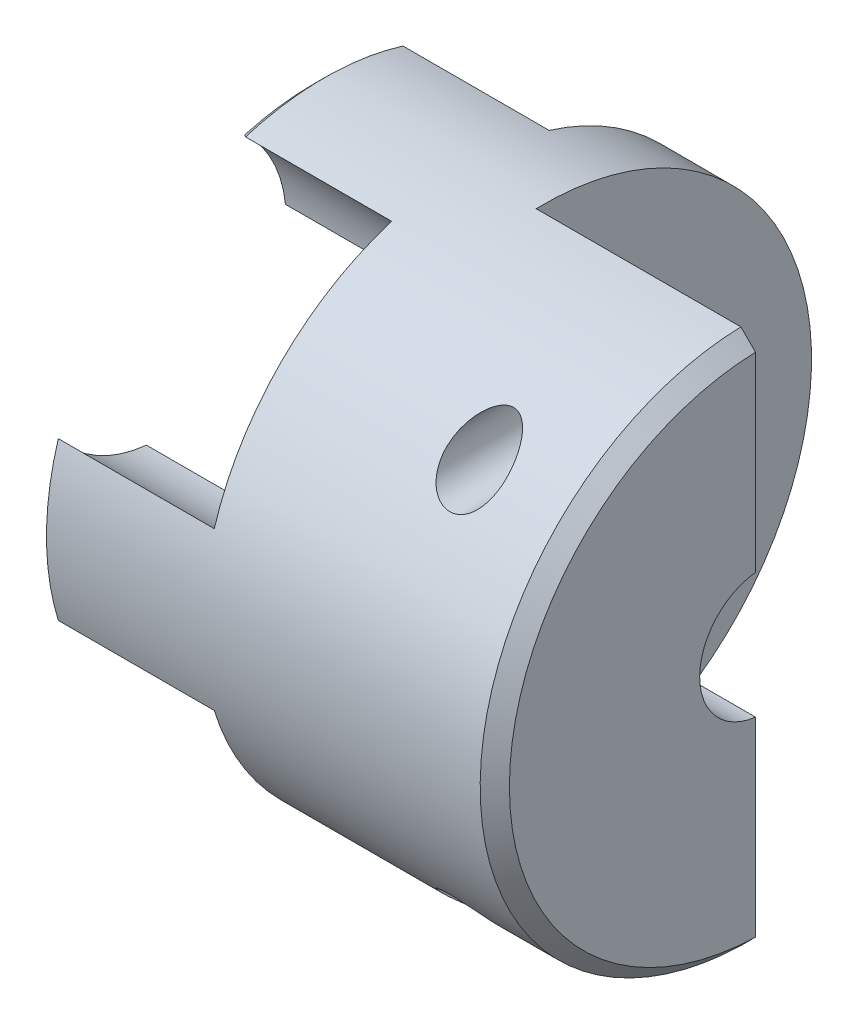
ISO-10303-21;
HEADER;
FILE_DESCRIPTION(('STEP AP214'),'2;1');
FILE_NAME('part.step','',(''),(''),'','','');
FILE_SCHEMA(('AUTOMOTIVE_DESIGN { 1 0 10303 214 1 1 1 1 }'));
ENDSEC;
DATA;
#1=APPLICATION_CONTEXT('core data for automotive mechanical design processes');
#2=APPLICATION_PROTOCOL_DEFINITION('international standard','automotive_design',2000,#1);
#3=PRODUCT_CONTEXT('',#1,'mechanical');
#4=PRODUCT('Part','Part','',(#3));
#5=PRODUCT_RELATED_PRODUCT_CATEGORY('part','',(#4));
#6=PRODUCT_DEFINITION_FORMATION('','',#4);
#7=PRODUCT_DEFINITION_CONTEXT('part definition',#1,'design');
#8=PRODUCT_DEFINITION('design','',#6,#7);
#9=PRODUCT_DEFINITION_SHAPE('','',#8);
#10=(LENGTH_UNIT() NAMED_UNIT(*) SI_UNIT(.MILLI.,.METRE.));
#11=(NAMED_UNIT(*) PLANE_ANGLE_UNIT() SI_UNIT($,.RADIAN.));
#12=(NAMED_UNIT(*) SI_UNIT($,.STERADIAN.) SOLID_ANGLE_UNIT());
#13=UNCERTAINTY_MEASURE_WITH_UNIT(LENGTH_MEASURE(1.E-05),#10,'distance_accuracy_value','');
#14=(GEOMETRIC_REPRESENTATION_CONTEXT(3) GLOBAL_UNCERTAINTY_ASSIGNED_CONTEXT((#13)) GLOBAL_UNIT_ASSIGNED_CONTEXT((#10,
#11,#12)) REPRESENTATION_CONTEXT('',''));
#15=CARTESIAN_POINT('',(0.,0.,0.));
#16=DIRECTION('',(0.,0.,1.));
#17=DIRECTION('',(1.,0.,0.));
#18=AXIS2_PLACEMENT_3D('',#15,#16,#17);
#19=CARTESIAN_POINT('',(0.,0.,0.));
#20=DIRECTION('',(1.,0.,0.));
#21=DIRECTION('',(0.,0.,-1.));
#22=AXIS2_PLACEMENT_3D('',#19,#20,#21);
#23=PLANE('',#22);
#24=CARTESIAN_POINT('',(0.,-15.9099025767,15.9099025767));
#25=DIRECTION('',(-1.,0.,0.));
#26=DIRECTION('',(0.,0.,1.));
#27=AXIS2_PLACEMENT_3D('',#24,#25,#26);
#28=CIRCLE('',#27,13.);
#29=CARTESIAN_POINT('',(3.34801630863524E-13,-25.5167588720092,7.15157441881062));
#30=VERTEX_POINT('',#29);
#31=CARTESIAN_POINT('',(0.,-17.2446487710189,2.97860517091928));
#32=VERTEX_POINT('',#31);
#33=EDGE_CURVE('E402',#30,#32,#28,.F.);
#34=ORIENTED_EDGE('',*,*,#33,.T.);
#35=CARTESIAN_POINT('',(0.,0.,0.));
#36=DIRECTION('',(-1.,0.,0.));
#37=DIRECTION('',(0.,0.,1.));
#38=AXIS2_PLACEMENT_3D('',#35,#36,#37);
#39=CIRCLE('',#38,17.5);
#40=CARTESIAN_POINT('',(0.,-17.2446487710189,-2.97860517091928));
#41=VERTEX_POINT('',#40);
#42=EDGE_CURVE('E403',#32,#41,#39,.F.);
#43=ORIENTED_EDGE('',*,*,#42,.T.);
#44=CARTESIAN_POINT('',(0.,-15.9099025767,-15.9099025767));
#45=DIRECTION('',(-1.,0.,0.));
#46=DIRECTION('',(0.,0.,1.));
#47=AXIS2_PLACEMENT_3D('',#44,#45,#46);
#48=CIRCLE('',#47,13.);
#49=CARTESIAN_POINT('',(3.34801630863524E-13,-25.5167588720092,-7.15157441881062));
#50=VERTEX_POINT('',#49);
#51=EDGE_CURVE('E409',#41,#50,#48,.F.);
#52=ORIENTED_EDGE('',*,*,#51,.T.);
#53=CARTESIAN_POINT('',(6.69603261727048E-13,0.,0.));
#54=DIRECTION('',(1.,0.,0.));
#55=DIRECTION('',(0.,0.,-1.));
#56=AXIS2_PLACEMENT_3D('',#53,#54,#55);
#57=CIRCLE('',#56,26.5000000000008);
#58=EDGE_CURVE('E406',#30,#50,#57,.T.);
#59=ORIENTED_EDGE('',*,*,#58,.F.);
#60=EDGE_LOOP('',(#34,#43,#52,#59));
#61=FACE_BOUND('',#60,.T.);
#62=ADVANCED_FACE('F16',(#61),#23,.F.);
#63=CARTESIAN_POINT('',(35.5,-20.,0.750000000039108));
#64=DIRECTION('',(0.,0.,-1.));
#65=DIRECTION('',(-1.,0.,0.));
#66=AXIS2_PLACEMENT_3D('',#63,#64,#65);
#67=CONICAL_SURFACE('',#66,3.02499999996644,0.39269908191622);
#68=CARTESIAN_POINT('',(35.5,-20.,0.750000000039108));
#69=DIRECTION('',(0.,0.,-1.));
#70=DIRECTION('',(-1.,0.,0.));
#71=AXIS2_PLACEMENT_3D('',#68,#69,#70);
#72=CIRCLE('',#71,3.02499999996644);
#73=CARTESIAN_POINT('',(32.4750000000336,-20.,0.750000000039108));
#74=VERTEX_POINT('',#73);
#75=EDGE_CURVE('E210',#74,#74,#72,.T.);
#76=ORIENTED_EDGE('',*,*,#75,.T.);
#77=EDGE_LOOP('',(#76));
#78=FACE_BOUND('',#77,.T.);
#79=CARTESIAN_POINT('',(35.5,-20.,0.8103553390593));
#80=DIRECTION('',(0.,0.,-1.));
#81=DIRECTION('',(-1.,0.,0.));
#82=AXIS2_PLACEMENT_3D('',#79,#80,#81);
#83=CIRCLE('',#82,3.);
#84=CARTESIAN_POINT('',(32.5,-20.,0.8103553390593));
#85=VERTEX_POINT('',#84);
#86=EDGE_CURVE('E212',#85,#85,#83,.F.);
#87=ORIENTED_EDGE('',*,*,#86,.T.);
#88=EDGE_LOOP('',(#87));
#89=FACE_BOUND('',#88,.T.);
#90=ADVANCED_FACE('F751',(#78,#89),#67,.F.);
#91=CARTESIAN_POINT('',(0.,0.,0.));
#92=DIRECTION('',(1.,0.,0.));
#93=DIRECTION('',(0.,0.,-1.));
#94=AXIS2_PLACEMENT_3D('',#91,#92,#93);
#95=PLANE('',#94);
#96=CARTESIAN_POINT('',(0.,0.,0.));
#97=DIRECTION('',(1.,0.,0.));
#98=DIRECTION('',(0.,0.,-1.));
#99=AXIS2_PLACEMENT_3D('',#96,#97,#98);
#100=CIRCLE('',#99,26.5000000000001);
#101=CARTESIAN_POINT('',(3.34801630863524E-13,-7.15157441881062,-25.5167588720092));
#102=VERTEX_POINT('',#101);
#103=CARTESIAN_POINT('',(0.,7.1515744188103,-25.5167588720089));
#104=VERTEX_POINT('',#103);
#105=EDGE_CURVE('E294',#102,#104,#100,.T.);
#106=ORIENTED_EDGE('',*,*,#105,.F.);
#107=CARTESIAN_POINT('',(0.,-15.9099025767,-15.9099025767));
#108=DIRECTION('',(-1.,0.,0.));
#109=DIRECTION('',(0.,0.,1.));
#110=AXIS2_PLACEMENT_3D('',#107,#108,#109);
#111=CIRCLE('',#110,13.);
#112=CARTESIAN_POINT('',(0.,-2.97860517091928,-17.2446487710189));
#113=VERTEX_POINT('',#112);
#114=EDGE_CURVE('E272',#102,#113,#111,.F.);
#115=ORIENTED_EDGE('',*,*,#114,.T.);
#116=CARTESIAN_POINT('',(0.,0.,0.));
#117=DIRECTION('',(-1.,0.,0.));
#118=DIRECTION('',(0.,0.,1.));
#119=AXIS2_PLACEMENT_3D('',#116,#117,#118);
#120=CIRCLE('',#119,17.5);
#121=CARTESIAN_POINT('',(0.,2.97860517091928,-17.2446487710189));
#122=VERTEX_POINT('',#121);
#123=EDGE_CURVE('E193',#113,#122,#120,.F.);
#124=ORIENTED_EDGE('',*,*,#123,.T.);
#125=CARTESIAN_POINT('',(0.,15.9099025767,-15.9099025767));
#126=DIRECTION('',(-1.,0.,0.));
#127=DIRECTION('',(0.,0.,1.));
#128=AXIS2_PLACEMENT_3D('',#125,#126,#127);
#129=CIRCLE('',#128,13.);
#130=EDGE_CURVE('E292',#122,#104,#129,.F.);
#131=ORIENTED_EDGE('',*,*,#130,.T.);
#132=EDGE_LOOP('',(#106,#115,#124,#131));
#133=FACE_BOUND('',#132,.T.);
#134=ADVANCED_FACE('F446',(#133),#95,.F.);
#135=CARTESIAN_POINT('',(0.,0.,0.));
#136=DIRECTION('',(1.,0.,0.));
#137=DIRECTION('',(0.,0.,-1.));
#138=AXIS2_PLACEMENT_3D('',#135,#136,#137);
#139=PLANE('',#138);
#140=CARTESIAN_POINT('',(0.,15.9099025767,-15.9099025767));
#141=DIRECTION('',(-1.,0.,0.));
#142=DIRECTION('',(0.,0.,1.));
#143=AXIS2_PLACEMENT_3D('',#140,#141,#142);
#144=CIRCLE('',#143,13.);
#145=CARTESIAN_POINT('',(3.34801630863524E-13,25.5167588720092,-7.15157441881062));
#146=VERTEX_POINT('',#145);
#147=CARTESIAN_POINT('',(0.,17.2446487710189,-2.97860517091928));
#148=VERTEX_POINT('',#147);
#149=EDGE_CURVE('E175',#146,#148,#144,.F.);
#150=ORIENTED_EDGE('',*,*,#149,.T.);
#151=CARTESIAN_POINT('',(0.,0.,0.));
#152=DIRECTION('',(-1.,0.,0.));
#153=DIRECTION('',(0.,0.,1.));
#154=AXIS2_PLACEMENT_3D('',#151,#152,#153);
#155=CIRCLE('',#154,17.5);
#156=CARTESIAN_POINT('',(0.,17.2446487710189,2.97860517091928));
#157=VERTEX_POINT('',#156);
#158=EDGE_CURVE('E19',#148,#157,#155,.F.);
#159=ORIENTED_EDGE('',*,*,#158,.T.);
#160=CARTESIAN_POINT('',(0.,15.9099025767,15.9099025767));
#161=DIRECTION('',(-1.,0.,0.));
#162=DIRECTION('',(0.,0.,1.));
#163=AXIS2_PLACEMENT_3D('',#160,#161,#162);
#164=CIRCLE('',#163,13.);
#165=CARTESIAN_POINT('',(3.34801630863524E-13,25.5167588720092,7.15157441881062));
#166=VERTEX_POINT('',#165);
#167=EDGE_CURVE('E206',#157,#166,#164,.F.);
#168=ORIENTED_EDGE('',*,*,#167,.T.);
#169=CARTESIAN_POINT('',(6.69603261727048E-13,0.,0.));
#170=DIRECTION('',(1.,0.,0.));
#171=DIRECTION('',(0.,0.,-1.));
#172=AXIS2_PLACEMENT_3D('',#169,#170,#171);
#173=CIRCLE('',#172,26.5000000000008);
#174=EDGE_CURVE('E180',#146,#166,#173,.T.);
#175=ORIENTED_EDGE('',*,*,#174,.F.);
#176=EDGE_LOOP('',(#150,#159,#168,#175));
#177=FACE_BOUND('',#176,.T.);
#178=ADVANCED_FACE('F177',(#177),#139,.F.);
#179=CARTESIAN_POINT('',(16.,0.,0.));
#180=DIRECTION('',(-1.,0.,0.));
#181=DIRECTION('',(0.,0.,1.));
#182=AXIS2_PLACEMENT_3D('',#179,#180,#181);
#183=CYLINDRICAL_SURFACE('',#182,17.5);
#184=ORIENTED_EDGE('',*,*,#158,.F.);
#185=DIRECTION('',(-1.,0.,0.));
#186=VECTOR('',#185,1.);
#187=CARTESIAN_POINT('',(16.,17.2446487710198,-2.97860517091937));
#188=LINE('',#187,#186);
#189=CARTESIAN_POINT('',(16.,17.2446487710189,-2.97860517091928));
#190=VERTEX_POINT('',#189);
#191=EDGE_CURVE('E184',#148,#190,#188,.F.);
#192=ORIENTED_EDGE('',*,*,#191,.T.);
#193=CARTESIAN_POINT('',(16.,0.,0.));
#194=DIRECTION('',(-1.,0.,0.));
#195=DIRECTION('',(0.,0.,1.));
#196=AXIS2_PLACEMENT_3D('',#193,#194,#195);
#197=CIRCLE('',#196,17.5);
#198=CARTESIAN_POINT('',(16.,17.2446487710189,2.97860517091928));
#199=VERTEX_POINT('',#198);
#200=EDGE_CURVE('E473',#199,#190,#197,.T.);
#201=ORIENTED_EDGE('',*,*,#200,.F.);
#202=DIRECTION('',(-1.,0.,0.));
#203=VECTOR('',#202,1.);
#204=CARTESIAN_POINT('',(16.,17.2446487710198,2.97860517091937));
#205=LINE('',#204,#203);
#206=EDGE_CURVE('E191',#199,#157,#205,.T.);
#207=ORIENTED_EDGE('',*,*,#206,.T.);
#208=EDGE_LOOP('',(#184,#192,#201,#207));
#209=FACE_BOUND('',#208,.T.);
#210=ADVANCED_FACE('F188',(#209),#183,.F.);
#211=CARTESIAN_POINT('',(16.,0.,0.));
#212=DIRECTION('',(-1.,0.,0.));
#213=DIRECTION('',(0.,0.,1.));
#214=AXIS2_PLACEMENT_3D('',#211,#212,#213);
#215=CYLINDRICAL_SURFACE('',#214,17.5);
#216=DIRECTION('',(-1.,0.,0.));
#217=VECTOR('',#216,1.);
#218=CARTESIAN_POINT('',(16.,-2.97860517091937,-17.2446487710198));
#219=LINE('',#218,#217);
#220=CARTESIAN_POINT('',(16.,-2.97860517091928,-17.2446487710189));
#221=VERTEX_POINT('',#220);
#222=EDGE_CURVE('E270',#113,#221,#219,.F.);
#223=ORIENTED_EDGE('',*,*,#222,.T.);
#224=CARTESIAN_POINT('',(16.,0.,0.));
#225=DIRECTION('',(-1.,0.,0.));
#226=DIRECTION('',(0.,0.,1.));
#227=AXIS2_PLACEMENT_3D('',#224,#225,#226);
#228=CIRCLE('',#227,17.5);
#229=CARTESIAN_POINT('',(16.,2.97860517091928,-17.2446487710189));
#230=VERTEX_POINT('',#229);
#231=EDGE_CURVE('E451',#230,#221,#228,.T.);
#232=ORIENTED_EDGE('',*,*,#231,.F.);
#233=DIRECTION('',(-1.,0.,0.));
#234=VECTOR('',#233,1.);
#235=CARTESIAN_POINT('',(16.,2.97860517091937,-17.2446487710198));
#236=LINE('',#235,#234);
#237=EDGE_CURVE('E203',#230,#122,#236,.T.);
#238=ORIENTED_EDGE('',*,*,#237,.T.);
#239=ORIENTED_EDGE('',*,*,#123,.F.);
#240=EDGE_LOOP('',(#223,#232,#238,#239));
#241=FACE_BOUND('',#240,.T.);
#242=ADVANCED_FACE('F449',(#241),#215,.F.);
#243=CARTESIAN_POINT('',(16.,0.,0.));
#244=DIRECTION('',(-1.,0.,0.));
#245=DIRECTION('',(0.,0.,1.));
#246=AXIS2_PLACEMENT_3D('',#243,#244,#245);
#247=CYLINDRICAL_SURFACE('',#246,17.5);
#248=CARTESIAN_POINT('',(16.,0.,0.));
#249=DIRECTION('',(-1.,0.,0.));
#250=DIRECTION('',(0.,0.,1.));
#251=AXIS2_PLACEMENT_3D('',#248,#249,#250);
#252=CIRCLE('',#251,17.5);
#253=CARTESIAN_POINT('',(16.,-17.2446487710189,-2.97860517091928));
#254=VERTEX_POINT('',#253);
#255=CARTESIAN_POINT('',(16.,-17.2446487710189,2.97860517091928));
#256=VERTEX_POINT('',#255);
#257=EDGE_CURVE('E530',#254,#256,#252,.T.);
#258=ORIENTED_EDGE('',*,*,#257,.F.);
#259=DIRECTION('',(-1.,0.,0.));
#260=VECTOR('',#259,1.);
#261=CARTESIAN_POINT('',(16.,-17.2446487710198,-2.97860517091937));
#262=LINE('',#261,#260);
#263=EDGE_CURVE('E407',#254,#41,#262,.T.);
#264=ORIENTED_EDGE('',*,*,#263,.T.);
#265=ORIENTED_EDGE('',*,*,#42,.F.);
#266=DIRECTION('',(-1.,0.,0.));
#267=VECTOR('',#266,1.);
#268=CARTESIAN_POINT('',(16.,-17.2446487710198,2.97860517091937));
#269=LINE('',#268,#267);
#270=EDGE_CURVE('E404',#32,#256,#269,.F.);
#271=ORIENTED_EDGE('',*,*,#270,.T.);
#272=EDGE_LOOP('',(#258,#264,#265,#271));
#273=FACE_BOUND('',#272,.T.);
#274=ADVANCED_FACE('F538',(#273),#247,.F.);
#275=CARTESIAN_POINT('',(16.,0.,0.));
#276=DIRECTION('',(-1.,0.,0.));
#277=DIRECTION('',(0.,0.,1.));
#278=AXIS2_PLACEMENT_3D('',#275,#276,#277);
#279=CYLINDRICAL_SURFACE('',#278,17.5);
#280=CARTESIAN_POINT('',(0.,0.,0.));
#281=DIRECTION('',(-1.,0.,0.));
#282=DIRECTION('',(0.,0.,1.));
#283=AXIS2_PLACEMENT_3D('',#280,#281,#282);
#284=CIRCLE('',#283,17.5);
#285=CARTESIAN_POINT('',(0.,-2.97860517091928,17.2446487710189));
#286=VERTEX_POINT('',#285);
#287=CARTESIAN_POINT('',(0.,2.97860517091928,17.2446487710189));
#288=VERTEX_POINT('',#287);
#289=EDGE_CURVE('E559',#286,#288,#284,.T.);
#290=ORIENTED_EDGE('',*,*,#289,.T.);
#291=DIRECTION('',(-1.,0.,0.));
#292=VECTOR('',#291,1.);
#293=CARTESIAN_POINT('',(16.,2.97860517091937,17.2446487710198));
#294=LINE('',#293,#292);
#295=CARTESIAN_POINT('',(16.,2.97860517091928,17.2446487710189));
#296=VERTEX_POINT('',#295);
#297=EDGE_CURVE('E394',#288,#296,#294,.F.);
#298=ORIENTED_EDGE('',*,*,#297,.T.);
#299=CARTESIAN_POINT('',(16.,0.,0.));
#300=DIRECTION('',(-1.,0.,0.));
#301=DIRECTION('',(0.,0.,1.));
#302=AXIS2_PLACEMENT_3D('',#299,#300,#301);
#303=CIRCLE('',#302,17.5);
#304=CARTESIAN_POINT('',(16.,-2.97860517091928,17.2446487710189));
#305=VERTEX_POINT('',#304);
#306=EDGE_CURVE('E520',#305,#296,#303,.T.);
#307=ORIENTED_EDGE('',*,*,#306,.F.);
#308=DIRECTION('',(-1.,0.,0.));
#309=VECTOR('',#308,1.);
#310=CARTESIAN_POINT('',(16.,-2.97860517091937,17.2446487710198));
#311=LINE('',#310,#309);
#312=EDGE_CURVE('E399',#305,#286,#311,.T.);
#313=ORIENTED_EDGE('',*,*,#312,.T.);
#314=EDGE_LOOP('',(#290,#298,#307,#313));
#315=FACE_BOUND('',#314,.T.);
#316=ADVANCED_FACE('F553',(#315),#279,.F.);
#317=CARTESIAN_POINT('',(16.,-15.9099025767,15.9099025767));
#318=DIRECTION('',(-1.,0.,0.));
#319=DIRECTION('',(0.,0.,1.));
#320=AXIS2_PLACEMENT_3D('',#317,#318,#319);
#321=CYLINDRICAL_SURFACE('',#320,13.);
#322=CARTESIAN_POINT('',(0.,-15.9099025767,15.9099025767));
#323=DIRECTION('',(-1.,0.,0.));
#324=DIRECTION('',(0.,0.,1.));
#325=AXIS2_PLACEMENT_3D('',#322,#323,#324);
#326=CIRCLE('',#325,13.);
#327=CARTESIAN_POINT('',(0.,-8.07884944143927,26.2865401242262));
#328=VERTEX_POINT('',#327);
#329=EDGE_CURVE('E550',#328,#286,#326,.T.);
#330=ORIENTED_EDGE('',*,*,#329,.T.);
#331=ORIENTED_EDGE('',*,*,#312,.F.);
#332=CARTESIAN_POINT('',(16.,-15.9099025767,15.9099025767));
#333=DIRECTION('',(-1.,0.,0.));
#334=DIRECTION('',(0.,0.,1.));
#335=AXIS2_PLACEMENT_3D('',#332,#333,#334);
#336=CIRCLE('',#335,13.);
#337=CARTESIAN_POINT('',(16.,-8.07884944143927,26.2865401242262));
#338=VERTEX_POINT('',#337);
#339=EDGE_CURVE('E522',#338,#305,#336,.T.);
#340=ORIENTED_EDGE('',*,*,#339,.F.);
#341=DIRECTION('',(-1.,0.,0.));
#342=VECTOR('',#341,1.);
#343=CARTESIAN_POINT('',(46.,-8.07884944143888,26.2865401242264));
#344=LINE('',#343,#342);
#345=EDGE_CURVE('E392',#328,#338,#344,.F.);
#346=ORIENTED_EDGE('',*,*,#345,.F.);
#347=EDGE_LOOP('',(#330,#331,#340,#346));
#348=FACE_BOUND('',#347,.T.);
#349=ADVANCED_FACE('F549',(#348),#321,.F.);
#350=CARTESIAN_POINT('',(16.,-15.9099025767,15.9099025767));
#351=DIRECTION('',(-1.,0.,0.));
#352=DIRECTION('',(0.,0.,1.));
#353=AXIS2_PLACEMENT_3D('',#350,#351,#352);
#354=CYLINDRICAL_SURFACE('',#353,13.);
#355=DIRECTION('',(-1.,0.,0.));
#356=VECTOR('',#355,1.);
#357=CARTESIAN_POINT('',(46.,-26.2865401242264,8.07884944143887));
#358=LINE('',#357,#356);
#359=CARTESIAN_POINT('',(16.,-26.2865401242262,8.07884944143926));
#360=VERTEX_POINT('',#359);
#361=CARTESIAN_POINT('',(1.00000000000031,-26.2865401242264,8.07884944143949));
#362=VERTEX_POINT('',#361);
#363=EDGE_CURVE('E388',#360,#362,#358,.T.);
#364=ORIENTED_EDGE('',*,*,#363,.F.);
#365=CARTESIAN_POINT('',(16.,-15.9099025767,15.9099025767));
#366=DIRECTION('',(-1.,0.,0.));
#367=DIRECTION('',(0.,0.,1.));
#368=AXIS2_PLACEMENT_3D('',#365,#366,#367);
#369=CIRCLE('',#368,13.);
#370=EDGE_CURVE('E528',#256,#360,#369,.T.);
#371=ORIENTED_EDGE('',*,*,#370,.F.);
#372=ORIENTED_EDGE('',*,*,#270,.F.);
#373=ORIENTED_EDGE('',*,*,#33,.F.);
#374=CARTESIAN_POINT('',(1.00000000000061,-26.2865401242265,8.07884944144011));
#375=CARTESIAN_POINT('',(0.917807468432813,-26.2254369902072,7.99788396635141));
#376=CARTESIAN_POINT('',(0.835311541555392,-26.16353479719,7.91783045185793));
#377=CARTESIAN_POINT('',(0.669763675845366,-26.0382065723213,7.75958714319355));
#378=CARTESIAN_POINT('',(0.58671194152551,-25.974781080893,7.68139670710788));
#379=CARTESIAN_POINT('',(0.420045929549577,-25.8464378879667,7.526862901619));
#380=CARTESIAN_POINT('',(0.336431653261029,-25.7815201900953,7.45051952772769));
#381=CARTESIAN_POINT('',(0.168631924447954,-25.650220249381,7.2996636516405));
#382=CARTESIAN_POINT('',(0.0844462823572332,-25.583837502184,7.22515179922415));
#383=CARTESIAN_POINT('',(4.70862496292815E-13,-25.516758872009,7.15157441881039));
#384=B_SPLINE_CURVE_WITH_KNOTS('',3,(#374,#375,#376,#377,#378,#379,#380,#381,#382,#383),
.UNSPECIFIED.,.F.,.F.,(4,2,2,2,4),(0.,0.391658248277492,0.783179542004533,1.17469988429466,
1.56635718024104),.UNSPECIFIED.);
#385=EDGE_CURVE('E410',#362,#30,#384,.T.);
#386=ORIENTED_EDGE('',*,*,#385,.F.);
#387=EDGE_LOOP('',(#364,#371,#372,#373,#386));
#388=FACE_BOUND('',#387,.T.);
#389=ADVANCED_FACE('F433',(#388),#354,.F.);
#390=CARTESIAN_POINT('',(1.00000000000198,0.,0.));
#391=DIRECTION('',(1.,0.,0.));
#392=DIRECTION('',(0.,0.,-1.));
#393=AXIS2_PLACEMENT_3D('',#390,#391,#392);
#394=CONICAL_SURFACE('',#393,27.5000000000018,0.785398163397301);
#395=CARTESIAN_POINT('',(1.,0.,0.));
#396=DIRECTION('',(-1.,0.,0.));
#397=DIRECTION('',(0.,0.,1.));
#398=AXIS2_PLACEMENT_3D('',#395,#396,#397);
#399=CIRCLE('',#398,27.5);
#400=CARTESIAN_POINT('',(1.00000000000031,-26.2865401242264,-8.07884944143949));
#401=VERTEX_POINT('',#400);
#402=EDGE_CURVE('E385',#362,#401,#399,.F.);
#403=ORIENTED_EDGE('',*,*,#402,.F.);
#404=ORIENTED_EDGE('',*,*,#385,.T.);
#405=ORIENTED_EDGE('',*,*,#58,.T.);
#406=CARTESIAN_POINT('',(4.65861179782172E-13,-25.516758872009,-7.15157441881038));
#407=CARTESIAN_POINT('',(0.0844462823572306,-25.583837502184,-7.22515179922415));
#408=CARTESIAN_POINT('',(0.168631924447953,-25.650220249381,-7.29966365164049));
#409=CARTESIAN_POINT('',(0.336431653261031,-25.7815201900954,-7.45051952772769));
#410=CARTESIAN_POINT('',(0.420045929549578,-25.8464378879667,-7.52686290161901));
#411=CARTESIAN_POINT('',(0.58671194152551,-25.974781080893,-7.68139670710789));
#412=CARTESIAN_POINT('',(0.669763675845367,-26.0382065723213,-7.75958714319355));
#413=CARTESIAN_POINT('',(0.835311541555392,-26.16353479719,-7.91783045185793));
#414=CARTESIAN_POINT('',(0.917807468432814,-26.2254369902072,-7.99788396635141));
#415=CARTESIAN_POINT('',(1.00000000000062,-26.2865401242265,-8.07884944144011));
#416=B_SPLINE_CURVE_WITH_KNOTS('',3,(#406,#407,#408,#409,#410,#411,#412,#413,#414,#415),
.UNSPECIFIED.,.F.,.F.,(4,2,2,2,4),(0.,0.391657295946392,0.783177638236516,1.17469893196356,
1.56635718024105),.UNSPECIFIED.);
#417=EDGE_CURVE('E415',#50,#401,#416,.T.);
#418=ORIENTED_EDGE('',*,*,#417,.T.);
#419=EDGE_LOOP('',(#403,#404,#405,#418));
#420=FACE_BOUND('',#419,.T.);
#421=ADVANCED_FACE('F429',(#420),#394,.T.);
#422=CARTESIAN_POINT('',(16.,-15.9099025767,-15.9099025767));
#423=DIRECTION('',(-1.,0.,0.));
#424=DIRECTION('',(0.,0.,1.));
#425=AXIS2_PLACEMENT_3D('',#422,#423,#424);
#426=CYLINDRICAL_SURFACE('',#425,13.);
#427=ORIENTED_EDGE('',*,*,#51,.F.);
#428=ORIENTED_EDGE('',*,*,#263,.F.);
#429=CARTESIAN_POINT('',(16.,-15.9099025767,-15.9099025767));
#430=DIRECTION('',(-1.,0.,0.));
#431=DIRECTION('',(0.,0.,1.));
#432=AXIS2_PLACEMENT_3D('',#429,#430,#431);
#433=CIRCLE('',#432,13.);
#434=CARTESIAN_POINT('',(16.,-26.2865401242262,-8.07884944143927));
#435=VERTEX_POINT('',#434);
#436=EDGE_CURVE('E462',#435,#254,#433,.T.);
#437=ORIENTED_EDGE('',*,*,#436,.F.);
#438=DIRECTION('',(-1.,0.,0.));
#439=VECTOR('',#438,1.);
#440=CARTESIAN_POINT('',(46.,-26.2865401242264,-8.07884944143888));
#441=LINE('',#440,#439);
#442=EDGE_CURVE('E382',#401,#435,#441,.F.);
#443=ORIENTED_EDGE('',*,*,#442,.F.);
#444=ORIENTED_EDGE('',*,*,#417,.F.);
#445=EDGE_LOOP('',(#427,#428,#437,#443,#444));
#446=FACE_BOUND('',#445,.T.);
#447=ADVANCED_FACE('F257',(#446),#426,.F.);
#448=CARTESIAN_POINT('',(16.,-15.9099025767,-15.9099025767));
#449=DIRECTION('',(-1.,0.,0.));
#450=DIRECTION('',(0.,0.,1.));
#451=AXIS2_PLACEMENT_3D('',#448,#449,#450);
#452=CYLINDRICAL_SURFACE('',#451,13.);
#453=DIRECTION('',(-1.,0.,0.));
#454=VECTOR('',#453,1.);
#455=CARTESIAN_POINT('',(46.,-8.07884944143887,-26.2865401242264));
#456=LINE('',#455,#454);
#457=CARTESIAN_POINT('',(16.,-8.07884944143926,-26.2865401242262));
#458=VERTEX_POINT('',#457);
#459=CARTESIAN_POINT('',(1.00000000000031,-8.07884944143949,-26.2865401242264));
#460=VERTEX_POINT('',#459);
#461=EDGE_CURVE('E241',#458,#460,#456,.T.);
#462=ORIENTED_EDGE('',*,*,#461,.F.);
#463=CARTESIAN_POINT('',(16.,-15.9099025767,-15.9099025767));
#464=DIRECTION('',(-1.,0.,0.));
#465=DIRECTION('',(0.,0.,1.));
#466=AXIS2_PLACEMENT_3D('',#463,#464,#465);
#467=CIRCLE('',#466,13.);
#468=EDGE_CURVE('E458',#221,#458,#467,.T.);
#469=ORIENTED_EDGE('',*,*,#468,.F.);
#470=ORIENTED_EDGE('',*,*,#222,.F.);
#471=ORIENTED_EDGE('',*,*,#114,.F.);
#472=CARTESIAN_POINT('',(1.00000000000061,-8.07884944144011,-26.2865401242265));
#473=CARTESIAN_POINT('',(0.917807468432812,-7.99788396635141,-26.2254369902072));
#474=CARTESIAN_POINT('',(0.835311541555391,-7.91783045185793,-26.16353479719));
#475=CARTESIAN_POINT('',(0.669763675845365,-7.75958714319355,-26.0382065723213));
#476=CARTESIAN_POINT('',(0.586711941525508,-7.68139670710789,-25.974781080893));
#477=CARTESIAN_POINT('',(0.420045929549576,-7.52686290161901,-25.8464378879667));
#478=CARTESIAN_POINT('',(0.336431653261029,-7.45051952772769,-25.7815201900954));
#479=CARTESIAN_POINT('',(0.168631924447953,-7.29966365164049,-25.650220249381));
#480=CARTESIAN_POINT('',(0.0844462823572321,-7.22515179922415,-25.583837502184));
#481=CARTESIAN_POINT('',(4.68177889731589E-13,-7.15157441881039,-25.516758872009));
#482=B_SPLINE_CURVE_WITH_KNOTS('',3,(#472,#473,#474,#475,#476,#477,#478,#479,#480,#481),
.UNSPECIFIED.,.F.,.F.,(4,2,2,2,4),(0.,0.391658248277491,0.783179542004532,1.17469988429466,
1.56635718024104),.UNSPECIFIED.);
#483=EDGE_CURVE('E215',#460,#102,#482,.T.);
#484=ORIENTED_EDGE('',*,*,#483,.F.);
#485=EDGE_LOOP('',(#462,#469,#470,#471,#484));
#486=FACE_BOUND('',#485,.T.);
#487=ADVANCED_FACE('F251',(#486),#452,.F.);
#488=CARTESIAN_POINT('',(35.5,-20.,0.75));
#489=DIRECTION('',(0.,0.,-1.));
#490=DIRECTION('',(-1.,0.,0.));
#491=AXIS2_PLACEMENT_3D('',#488,#489,#490);
#492=CYLINDRICAL_SURFACE('',#491,3.);
#493=ORIENTED_EDGE('',*,*,#86,.F.);
#494=EDGE_LOOP('',(#493));
#495=FACE_BOUND('',#494,.T.);
#496=CARTESIAN_POINT('',(32.5,-19.9999999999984,18.8745860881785));
#497=CARTESIAN_POINT('',(32.5000003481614,-19.8923915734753,18.9886108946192));
#498=CARTESIAN_POINT('',(32.505783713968,-19.7838044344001,19.1017152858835));
#499=CARTESIAN_POINT('',(32.5296212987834,-19.5653448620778,19.3254164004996));
#500=CARTESIAN_POINT('',(32.5476767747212,-19.4554722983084,19.4360128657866));
#501=CARTESIAN_POINT('',(32.5968557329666,-19.2355202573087,19.6537184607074));
#502=CARTESIAN_POINT('',(32.627957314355,-19.125441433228,19.7608331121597));
#503=CARTESIAN_POINT('',(32.7041292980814,-18.9061181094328,19.9707724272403));
#504=CARTESIAN_POINT('',(32.749192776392,-18.7968732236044,20.0735991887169));
#505=CARTESIAN_POINT('',(32.871680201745,-18.5448237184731,20.3070890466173));
#506=CARTESIAN_POINT('',(32.9548769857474,-18.402860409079,20.4357203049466));
#507=CARTESIAN_POINT('',(33.1498736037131,-18.1277688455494,20.6801297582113));
#508=CARTESIAN_POINT('',(33.2616374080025,-17.9946297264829,20.7959238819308));
#509=CARTESIAN_POINT('',(33.49097932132,-17.7673440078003,20.9902241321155));
#510=CARTESIAN_POINT('',(33.6034741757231,-17.6705818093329,21.0716424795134));
#511=CARTESIAN_POINT('',(33.8476434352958,-17.4915019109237,21.2205301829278));
#512=CARTESIAN_POINT('',(33.9792980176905,-17.4091694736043,21.2880137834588));
#513=CARTESIAN_POINT('',(34.2387641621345,-17.2746873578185,21.3972325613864));
#514=CARTESIAN_POINT('',(34.3641973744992,-17.2198638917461,21.4413104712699));
#515=CARTESIAN_POINT('',(34.6250898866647,-17.1270808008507,21.5154979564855));
#516=CARTESIAN_POINT('',(34.7605451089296,-17.0891143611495,21.5456131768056));
#517=CARTESIAN_POINT('',(35.0384985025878,-17.0323055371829,21.5905515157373));
#518=CARTESIAN_POINT('',(35.1810229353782,-17.0135410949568,21.6053123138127));
#519=CARTESIAN_POINT('',(35.4680386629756,-16.9967308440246,21.6185399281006));
#520=CARTESIAN_POINT('',(35.6125295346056,-16.9986806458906,21.6170101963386));
#521=CARTESIAN_POINT('',(35.8883280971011,-17.0222522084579,21.5984515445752));
#522=CARTESIAN_POINT('',(36.0198378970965,-17.0424526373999,21.5825424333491));
#523=CARTESIAN_POINT('',(36.2768485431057,-17.0993390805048,21.5374999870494));
#524=CARTESIAN_POINT('',(36.4023492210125,-17.136025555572,21.5083662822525));
#525=CARTESIAN_POINT('',(36.6479702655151,-17.2251621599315,21.4370500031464));
#526=CARTESIAN_POINT('',(36.7678356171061,-17.2780314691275,21.3945194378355));
#527=CARTESIAN_POINT('',(36.9961643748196,-17.3965292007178,21.298276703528));
#528=CARTESIAN_POINT('',(37.1046243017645,-17.4621614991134,21.244561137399));
#529=CARTESIAN_POINT('',(37.322226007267,-17.612703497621,21.1199756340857));
#530=CARTESIAN_POINT('',(37.4296401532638,-17.6990087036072,21.0477853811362));
#531=CARTESIAN_POINT('',(37.6279519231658,-17.8810425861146,20.893363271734));
#532=CARTESIAN_POINT('',(37.7188358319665,-17.9767789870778,20.8111231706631));
#533=CARTESIAN_POINT('',(37.9281398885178,-18.2271349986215,20.5927565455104));
#534=CARTESIAN_POINT('',(38.035680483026,-18.386104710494,20.4511446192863));
#535=CARTESIAN_POINT('',(38.2153732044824,-18.7110629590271,20.1542756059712));
#536=CARTESIAN_POINT('',(38.2874654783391,-18.8770628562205,19.9989959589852));
#537=CARTESIAN_POINT('',(38.3973801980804,-19.2039325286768,19.6852309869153));
#538=CARTESIAN_POINT('',(38.4364355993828,-19.3647482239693,19.5271101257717));
#539=CARTESIAN_POINT('',(38.48774476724,-19.6844168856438,19.2048237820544));
#540=CARTESIAN_POINT('',(38.5000013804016,-19.8432700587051,19.0406589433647));
#541=CARTESIAN_POINT('',(38.499998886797,-20.1263923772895,18.7406592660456));
#542=CARTESIAN_POINT('',(38.4920259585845,-20.2514039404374,18.6054915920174));
#543=CARTESIAN_POINT('',(38.4610018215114,-20.4979025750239,18.3335665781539));
#544=CARTESIAN_POINT('',(38.4379436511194,-20.6193879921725,18.1968085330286));
#545=CARTESIAN_POINT('',(38.3772539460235,-20.8582712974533,17.9224907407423));
#546=CARTESIAN_POINT('',(38.3395939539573,-20.9756607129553,17.7849299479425));
#547=CARTESIAN_POINT('',(38.2499407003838,-21.2054175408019,17.5103478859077));
#548=CARTESIAN_POINT('',(38.1979525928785,-21.3177867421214,17.3733264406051));
#549=CARTESIAN_POINT('',(38.0930765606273,-21.5116710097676,17.1323129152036));
#550=CARTESIAN_POINT('',(38.0431374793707,-21.5943451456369,17.0279625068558));
#551=CARTESIAN_POINT('',(37.9343724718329,-21.7559376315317,16.821010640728));
#552=CARTESIAN_POINT('',(37.8755483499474,-21.8348567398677,16.7184088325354));
#553=CARTESIAN_POINT('',(37.7486928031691,-21.9882825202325,16.5160983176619));
#554=CARTESIAN_POINT('',(37.6806848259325,-22.0627997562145,16.4163830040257));
#555=CARTESIAN_POINT('',(37.534684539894,-22.2069380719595,16.2208704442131));
#556=CARTESIAN_POINT('',(37.4566983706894,-22.276562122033,16.1250708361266));
#557=CARTESIAN_POINT('',(37.2807240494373,-22.4172434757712,15.9290067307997));
#558=CARTESIAN_POINT('',(37.1814852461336,-22.4876431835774,15.8293777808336));
#559=CARTESIAN_POINT('',(36.9679250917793,-22.6193338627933,15.6406177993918));
#560=CARTESIAN_POINT('',(36.8536165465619,-22.6806324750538,15.5514779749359));
#561=CARTESIAN_POINT('',(36.6362959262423,-22.7784212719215,15.4077678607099));
#562=CARTESIAN_POINT('',(36.5365870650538,-22.8173859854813,15.3499402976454));
#563=CARTESIAN_POINT('',(36.3273773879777,-22.8857391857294,15.2478431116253));
#564=CARTESIAN_POINT('',(36.2178946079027,-22.915144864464,15.2035491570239));
#565=CARTESIAN_POINT('',(36.0138400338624,-22.9571106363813,15.1400867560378));
#566=CARTESIAN_POINT('',(35.9207555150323,-22.9718790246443,15.1176425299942));
#567=CARTESIAN_POINT('',(35.7313927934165,-22.9925742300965,15.086149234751));
#568=CARTESIAN_POINT('',(35.6351175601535,-22.9985090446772,15.0770880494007));
#569=CARTESIAN_POINT('',(35.4419550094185,-23.0009959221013,15.0732940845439));
#570=CARTESIAN_POINT('',(35.3450668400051,-22.997528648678,15.0785908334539));
#571=CARTESIAN_POINT('',(35.1538138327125,-22.9815080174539,15.1029960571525));
#572=CARTESIAN_POINT('',(35.0594509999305,-22.9689476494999,15.1221151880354));
#573=CARTESIAN_POINT('',(34.8545213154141,-22.9319843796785,15.1781237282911));
#574=CARTESIAN_POINT('',(34.7451722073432,-22.9055327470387,15.2180731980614));
#575=CARTESIAN_POINT('',(34.5356681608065,-22.8429009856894,15.3119253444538));
#576=CARTESIAN_POINT('',(34.4355312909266,-22.8067022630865,15.3658546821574));
#577=CARTESIAN_POINT('',(34.1953698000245,-22.7060343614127,15.5144316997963));
#578=CARTESIAN_POINT('',(34.0615609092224,-22.6366352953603,15.615698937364));
#579=CARTESIAN_POINT('',(33.8138949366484,-22.4855931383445,15.8324250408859));
#580=CARTESIAN_POINT('',(33.7000894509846,-22.4039193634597,15.9479193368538));
#581=CARTESIAN_POINT('',(33.5085227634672,-22.2464525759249,16.166640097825));
#582=CARTESIAN_POINT('',(33.4279374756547,-22.1721218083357,16.2684886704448));
#583=CARTESIAN_POINT('',(33.2777080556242,-22.0181669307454,16.4762571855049));
#584=CARTESIAN_POINT('',(33.2080707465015,-21.9385395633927,16.5821796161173));
#585=CARTESIAN_POINT('',(33.0789501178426,-21.7746568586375,16.7968026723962));
#586=CARTESIAN_POINT('',(33.0194787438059,-21.6903962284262,16.9055063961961));
#587=CARTESIAN_POINT('',(32.9103091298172,-21.5178663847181,17.1245691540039));
#588=CARTESIAN_POINT('',(32.8606093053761,-21.4295978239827,17.2349279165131));
#589=CARTESIAN_POINT('',(32.7639877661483,-21.2359734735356,17.4731328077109));
#590=CARTESIAN_POINT('',(32.7185923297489,-21.1300360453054,17.6011266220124));
#591=CARTESIAN_POINT('',(32.6402865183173,-20.9139189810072,17.8573821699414));
#592=CARTESIAN_POINT('',(32.6073783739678,-20.803738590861,17.9856439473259));
#593=CARTESIAN_POINT('',(32.5542916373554,-20.5797002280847,18.2415694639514));
#594=CARTESIAN_POINT('',(32.534111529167,-20.4658426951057,18.3692332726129));
#595=CARTESIAN_POINT('',(32.5069665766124,-20.2350494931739,18.6231629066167));
#596=CARTESIAN_POINT('',(32.4999996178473,-20.1181143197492,18.7494289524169));
#597=CARTESIAN_POINT('',(32.5,-19.9999999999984,18.8745860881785));
#598=B_SPLINE_CURVE_WITH_KNOTS('',3,(#496,#497,#498,#499,#500,#501,#502,#503,#504,#505,#506,
#507,#508,#509,#510,#511,#512,#513,#514,#515,#516,#517,#518,#519,#520,#521,#522,#523,#524,#525,
#526,#527,#528,#529,#530,#531,#532,#533,#534,#535,#536,#537,#538,#539,#540,#541,#542,#543,#544,
#545,#546,#547,#548,#549,#550,#551,#552,#553,#554,#555,#556,#557,#558,#559,#560,#561,#562,#563,
#564,#565,#566,#567,#568,#569,#570,#571,#572,#573,#574,#575,#576,#577,#578,#579,#580,#581,#582,
#583,#584,#585,#586,#587,#588,#589,#590,#591,#592,#593,#594,#595,#596,#597),.UNSPECIFIED.,.T.,
.F.,(4,2,2,2,2,2,2,2,2,2,2,2,2,2,2,2,2,2,2,2,2,2,2,2,2,2,2,2,2,2,2,2,2,2,2,2,2,2,2,2,2,2,2,2,2,
2,2,2,2,2,4),(0.,0.470228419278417,0.940505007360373,1.40999526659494,1.87925306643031,
2.50360003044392,3.12716339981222,3.63297665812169,4.1382702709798,4.56787515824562,
4.99730620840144,5.42847351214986,5.85954945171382,6.25969934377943,6.6598604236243,
7.07141773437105,7.48310022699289,7.94805100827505,8.41338581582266,9.1249720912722,
9.83775576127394,10.5225893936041,11.2073502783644,11.7595648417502,12.3120344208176,
12.8655861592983,13.4189390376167,13.8452056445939,14.2713858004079,14.696497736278,
15.1213493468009,15.5920940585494,16.0624412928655,16.4262830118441,16.7894666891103,
17.0788929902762,17.3680571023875,17.6578163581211,17.9477992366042,18.3039727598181,
18.6608306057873,19.2025880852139,19.745723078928,20.194046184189,20.642647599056,
21.0917725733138,21.5408246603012,22.0570137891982,22.5732950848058,23.0895148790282,
23.605652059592),.UNSPECIFIED.);
#599=CARTESIAN_POINT('',(32.5,-19.9999999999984,18.8745860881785));
#600=VERTEX_POINT('',#599);
#601=EDGE_CURVE('E232',#600,#600,#598,.T.);
#602=ORIENTED_EDGE('',*,*,#601,.F.);
#603=EDGE_LOOP('',(#602));
#604=FACE_BOUND('',#603,.T.);
#605=ADVANCED_FACE('F245',(#495,#604),#492,.F.);
#606=CARTESIAN_POINT('',(46.,0.,0.));
#607=DIRECTION('',(1.,0.,0.));
#608=DIRECTION('',(0.,0.,-1.));
#609=AXIS2_PLACEMENT_3D('',#606,#607,#608);
#610=PLANE('',#609);
#611=CARTESIAN_POINT('',(46.,0.,-1.25373862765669E-11));
#612=DIRECTION('',(-1.,0.,0.));
#613=DIRECTION('',(0.,0.,1.));
#614=AXIS2_PLACEMENT_3D('',#611,#612,#613);
#615=CIRCLE('',#614,6.477);
#616=CARTESIAN_POINT('',(46.,-6.4334305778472,0.75));
#617=VERTEX_POINT('',#616);
#618=CARTESIAN_POINT('',(46.,6.43343057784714,0.75));
#619=VERTEX_POINT('',#618);
#620=EDGE_CURVE('E214',#617,#619,#615,.T.);
#621=ORIENTED_EDGE('',*,*,#620,.T.);
#622=DIRECTION('',(0.,1.,0.));
#623=VECTOR('',#622,1.);
#624=CARTESIAN_POINT('',(46.,-16.00282098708,0.75));
#625=LINE('',#624,#623);
#626=CARTESIAN_POINT('',(46.0000000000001,25.9891804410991,0.75));
#627=VERTEX_POINT('',#626);
#628=EDGE_CURVE('E325',#619,#627,#625,.T.);
#629=ORIENTED_EDGE('',*,*,#628,.T.);
#630=CARTESIAN_POINT('',(46.0000000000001,0.,0.));
#631=DIRECTION('',(-1.,0.,0.));
#632=DIRECTION('',(0.,0.,1.));
#633=AXIS2_PLACEMENT_3D('',#630,#631,#632);
#634=CIRCLE('',#633,26.0000000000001);
#635=CARTESIAN_POINT('',(45.9999999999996,-25.9891804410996,0.75));
#636=VERTEX_POINT('',#635);
#637=EDGE_CURVE('E240',#636,#627,#634,.T.);
#638=ORIENTED_EDGE('',*,*,#637,.F.);
#639=DIRECTION('',(0.,1.,0.));
#640=VECTOR('',#639,1.);
#641=CARTESIAN_POINT('',(46.,-16.00282098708,0.75));
#642=LINE('',#641,#640);
#643=EDGE_CURVE('E207',#636,#617,#642,.T.);
#644=ORIENTED_EDGE('',*,*,#643,.T.);
#645=EDGE_LOOP('',(#621,#629,#638,#644));
#646=FACE_BOUND('',#645,.T.);
#647=ADVANCED_FACE('F250',(#646),#610,.T.);
#648=CARTESIAN_POINT('',(-30.6,0.,-1.091393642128E-11));
#649=DIRECTION('',(-1.,0.,0.));
#650=DIRECTION('',(0.,0.,1.));
#651=AXIS2_PLACEMENT_3D('',#648,#649,#650);
#652=CYLINDRICAL_SURFACE('',#651,6.477);
#653=CARTESIAN_POINT('',(16.0000000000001,0.,-1.19015704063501E-11));
#654=DIRECTION('',(-1.,0.,0.));
#655=DIRECTION('',(0.,0.,1.));
#656=AXIS2_PLACEMENT_3D('',#653,#654,#655);
#657=CIRCLE('',#656,6.477);
#658=CARTESIAN_POINT('',(16.0000000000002,0.,6.4769999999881));
#659=VERTEX_POINT('',#658);
#660=EDGE_CURVE('E398',#659,#659,#657,.F.);
#661=ORIENTED_EDGE('',*,*,#660,.F.);
#662=EDGE_LOOP('',(#661));
#663=FACE_BOUND('',#662,.T.);
#664=CARTESIAN_POINT('',(23.5,0.,-1.20605243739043E-11));
#665=DIRECTION('',(1.,0.,0.));
#666=DIRECTION('',(0.,0.,-1.));
#667=AXIS2_PLACEMENT_3D('',#664,#665,#666);
#668=CIRCLE('',#667,6.477);
#669=CARTESIAN_POINT('',(23.5,6.43343057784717,0.75));
#670=VERTEX_POINT('',#669);
#671=CARTESIAN_POINT('',(23.5,-6.43343057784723,0.75));
#672=VERTEX_POINT('',#671);
#673=EDGE_CURVE('E328',#670,#672,#668,.F.);
#674=ORIENTED_EDGE('',*,*,#673,.F.);
#675=DIRECTION('',(1.,0.,0.));
#676=VECTOR('',#675,1.);
#677=CARTESIAN_POINT('',(63.49656956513,6.433430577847,0.75));
#678=LINE('',#677,#676);
#679=EDGE_CURVE('E376',#670,#619,#678,.T.);
#680=ORIENTED_EDGE('',*,*,#679,.T.);
#681=ORIENTED_EDGE('',*,*,#620,.F.);
#682=DIRECTION('',(1.,0.,0.));
#683=VECTOR('',#682,1.);
#684=CARTESIAN_POINT('',(63.49656956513,-6.433430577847,0.75));
#685=LINE('',#684,#683);
#686=EDGE_CURVE('E304',#617,#672,#685,.F.);
#687=ORIENTED_EDGE('',*,*,#686,.T.);
#688=EDGE_LOOP('',(#674,#680,#681,#687));
#689=FACE_BOUND('',#688,.T.);
#690=ADVANCED_FACE('F662',(#663,#689),#652,.F.);
#691=CARTESIAN_POINT('',(63.49656956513,-16.00282098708,0.75));
#692=DIRECTION('',(0.,0.,1.));
#693=DIRECTION('',(1.,0.,0.));
#694=AXIS2_PLACEMENT_3D('',#691,#692,#693);
#695=PLANE('',#694);
#696=ORIENTED_EDGE('',*,*,#75,.F.);
#697=EDGE_LOOP('',(#696));
#698=FACE_BOUND('',#697,.T.);
#699=CARTESIAN_POINT('',(44.4999999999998,-27.4897708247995,0.75));
#700=CARTESIAN_POINT('',(44.7500027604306,-27.2396751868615,0.75));
#701=CARTESIAN_POINT('',(45.0000041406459,-26.9895781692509,0.75));
#702=CARTESIAN_POINT('',(45.5000041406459,-26.4893813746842,0.75));
#703=CARTESIAN_POINT('',(45.7500027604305,-26.2392815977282,0.75));
#704=CARTESIAN_POINT('',(45.9999999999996,-25.9891804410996,0.75));
#705=B_SPLINE_CURVE_WITH_KNOTS('',3,(#699,#700,#701,#702,#703,#704),.UNSPECIFIED.,.F.,.F.,(4,2,
4),(0.,1.06086892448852,2.12173784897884),.UNSPECIFIED.);
#706=CARTESIAN_POINT('',(44.4999999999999,-27.4897708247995,0.749999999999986));
#707=VERTEX_POINT('',#706);
#708=EDGE_CURVE('E211',#707,#636,#705,.T.);
#709=ORIENTED_EDGE('',*,*,#708,.F.);
#710=DIRECTION('',(-1.,0.,0.));
#711=VECTOR('',#710,1.);
#712=CARTESIAN_POINT('',(46.,-27.4897708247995,0.749999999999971));
#713=LINE('',#712,#711);
#714=CARTESIAN_POINT('',(23.5,-27.4897708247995,0.749999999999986));
#715=VERTEX_POINT('',#714);
#716=EDGE_CURVE('E357',#715,#707,#713,.F.);
#717=ORIENTED_EDGE('',*,*,#716,.F.);
#718=DIRECTION('',(0.,1.,0.));
#719=VECTOR('',#718,1.);
#720=CARTESIAN_POINT('',(23.5,-30.70596061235,0.75));
#721=LINE('',#720,#719);
#722=EDGE_CURVE('E331',#672,#715,#721,.F.);
#723=ORIENTED_EDGE('',*,*,#722,.F.);
#724=ORIENTED_EDGE('',*,*,#686,.F.);
#725=ORIENTED_EDGE('',*,*,#643,.F.);
#726=EDGE_LOOP('',(#709,#717,#723,#724,#725));
#727=FACE_BOUND('',#726,.T.);
#728=ADVANCED_FACE('F305',(#698,#727),#695,.F.);
#729=CARTESIAN_POINT('',(35.5,20.,0.750000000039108));
#730=DIRECTION('',(0.,0.,-1.));
#731=DIRECTION('',(-1.,0.,0.));
#732=AXIS2_PLACEMENT_3D('',#729,#730,#731);
#733=CONICAL_SURFACE('',#732,3.02499999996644,0.39269908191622);
#734=CARTESIAN_POINT('',(35.5,20.,0.750000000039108));
#735=DIRECTION('',(0.,0.,-1.));
#736=DIRECTION('',(-1.,0.,0.));
#737=AXIS2_PLACEMENT_3D('',#734,#735,#736);
#738=CIRCLE('',#737,3.02499999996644);
#739=CARTESIAN_POINT('',(32.4750000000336,20.,0.750000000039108));
#740=VERTEX_POINT('',#739);
#741=EDGE_CURVE('E324',#740,#740,#738,.T.);
#742=ORIENTED_EDGE('',*,*,#741,.T.);
#743=EDGE_LOOP('',(#742));
#744=FACE_BOUND('',#743,.T.);
#745=CARTESIAN_POINT('',(35.5,20.,0.8103553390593));
#746=DIRECTION('',(0.,0.,-1.));
#747=DIRECTION('',(-1.,0.,0.));
#748=AXIS2_PLACEMENT_3D('',#745,#746,#747);
#749=CIRCLE('',#748,3.);
#750=CARTESIAN_POINT('',(32.5,20.,0.8103553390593));
#751=VERTEX_POINT('',#750);
#752=EDGE_CURVE('E334',#751,#751,#749,.F.);
#753=ORIENTED_EDGE('',*,*,#752,.T.);
#754=EDGE_LOOP('',(#753));
#755=FACE_BOUND('',#754,.T.);
#756=ADVANCED_FACE('F280',(#744,#755),#733,.F.);
#757=CARTESIAN_POINT('',(1.00000000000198,0.,0.));
#758=DIRECTION('',(1.,0.,0.));
#759=DIRECTION('',(0.,0.,-1.));
#760=AXIS2_PLACEMENT_3D('',#757,#758,#759);
#761=CONICAL_SURFACE('',#760,27.5000000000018,0.7853981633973);
#762=CARTESIAN_POINT('',(1.,0.,0.));
#763=DIRECTION('',(-1.,0.,0.));
#764=DIRECTION('',(0.,0.,1.));
#765=AXIS2_PLACEMENT_3D('',#762,#763,#764);
#766=CIRCLE('',#765,27.5);
#767=CARTESIAN_POINT('',(1.00000000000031,8.07884944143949,-26.2865401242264));
#768=VERTEX_POINT('',#767);
#769=EDGE_CURVE('E368',#460,#768,#766,.F.);
#770=ORIENTED_EDGE('',*,*,#769,.F.);
#771=ORIENTED_EDGE('',*,*,#483,.T.);
#772=ORIENTED_EDGE('',*,*,#105,.T.);
#773=CARTESIAN_POINT('',(3.66191598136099E-13,7.1515744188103,-25.5167588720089));
#774=CARTESIAN_POINT('',(0.0844462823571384,7.22515179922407,-25.5838375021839));
#775=CARTESIAN_POINT('',(0.168631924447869,7.29966365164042,-25.6502202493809));
#776=CARTESIAN_POINT('',(0.336431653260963,7.45051952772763,-25.7815201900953));
#777=CARTESIAN_POINT('',(0.42004592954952,7.52686290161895,-25.8464378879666));
#778=CARTESIAN_POINT('',(0.586711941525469,7.68139670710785,-25.9747810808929));
#779=CARTESIAN_POINT('',(0.669763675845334,7.75958714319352,-26.0382065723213));
#780=CARTESIAN_POINT('',(0.835311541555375,7.91783045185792,-26.1635347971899));
#781=CARTESIAN_POINT('',(0.917807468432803,7.9978839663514,-26.2254369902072));
#782=CARTESIAN_POINT('',(1.00000000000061,8.07884944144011,-26.2865401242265));
#783=B_SPLINE_CURVE_WITH_KNOTS('',3,(#773,#774,#775,#776,#777,#778,#779,#780,#781,#782),
.UNSPECIFIED.,.F.,.F.,(4,2,2,2,4),(0.,0.391657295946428,0.78317763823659,1.17469893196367,
1.5663571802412),.UNSPECIFIED.);
#784=EDGE_CURVE('E185',#104,#768,#783,.T.);
#785=ORIENTED_EDGE('',*,*,#784,.T.);
#786=EDGE_LOOP('',(#770,#771,#772,#785));
#787=FACE_BOUND('',#786,.T.);
#788=ADVANCED_FACE('F274',(#787),#761,.T.);
#789=CARTESIAN_POINT('',(16.,15.9099025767,-15.9099025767));
#790=DIRECTION('',(-1.,0.,0.));
#791=DIRECTION('',(0.,0.,1.));
#792=AXIS2_PLACEMENT_3D('',#789,#790,#791);
#793=CYLINDRICAL_SURFACE('',#792,13.);
#794=ORIENTED_EDGE('',*,*,#130,.F.);
#795=ORIENTED_EDGE('',*,*,#237,.F.);
#796=CARTESIAN_POINT('',(16.,15.9099025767,-15.9099025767));
#797=DIRECTION('',(-1.,0.,0.));
#798=DIRECTION('',(0.,0.,1.));
#799=AXIS2_PLACEMENT_3D('',#796,#797,#798);
#800=CIRCLE('',#799,13.);
#801=CARTESIAN_POINT('',(16.,8.07884944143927,-26.2865401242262));
#802=VERTEX_POINT('',#801);
#803=EDGE_CURVE('E467',#802,#230,#800,.T.);
#804=ORIENTED_EDGE('',*,*,#803,.F.);
#805=DIRECTION('',(-1.,0.,0.));
#806=VECTOR('',#805,1.);
#807=CARTESIAN_POINT('',(46.,8.07884944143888,-26.2865401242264));
#808=LINE('',#807,#806);
#809=EDGE_CURVE('E339',#768,#802,#808,.F.);
#810=ORIENTED_EDGE('',*,*,#809,.F.);
#811=ORIENTED_EDGE('',*,*,#784,.F.);
#812=EDGE_LOOP('',(#794,#795,#804,#810,#811));
#813=FACE_BOUND('',#812,.T.);
#814=ADVANCED_FACE('F279',(#813),#793,.F.);
#815=CARTESIAN_POINT('',(16.,15.9099025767,-15.9099025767));
#816=DIRECTION('',(-1.,0.,0.));
#817=DIRECTION('',(0.,0.,1.));
#818=AXIS2_PLACEMENT_3D('',#815,#816,#817);
#819=CYLINDRICAL_SURFACE('',#818,13.);
#820=DIRECTION('',(-1.,0.,0.));
#821=VECTOR('',#820,1.);
#822=CARTESIAN_POINT('',(46.,26.2865401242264,-8.07884944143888));
#823=LINE('',#822,#821);
#824=CARTESIAN_POINT('',(16.,26.2865401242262,-8.07884944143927));
#825=VERTEX_POINT('',#824);
#826=CARTESIAN_POINT('',(1.00000000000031,26.2865401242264,-8.07884944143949));
#827=VERTEX_POINT('',#826);
#828=EDGE_CURVE('E338',#825,#827,#823,.T.);
#829=ORIENTED_EDGE('',*,*,#828,.F.);
#830=CARTESIAN_POINT('',(16.,15.9099025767,-15.9099025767));
#831=DIRECTION('',(-1.,0.,0.));
#832=DIRECTION('',(0.,0.,1.));
#833=AXIS2_PLACEMENT_3D('',#830,#831,#832);
#834=CIRCLE('',#833,13.);
#835=EDGE_CURVE('E196',#190,#825,#834,.T.);
#836=ORIENTED_EDGE('',*,*,#835,.F.);
#837=ORIENTED_EDGE('',*,*,#191,.F.);
#838=ORIENTED_EDGE('',*,*,#149,.F.);
#839=CARTESIAN_POINT('',(1.00000000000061,26.2865401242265,-8.07884944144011));
#840=CARTESIAN_POINT('',(0.917807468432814,26.2254369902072,-7.99788396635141));
#841=CARTESIAN_POINT('',(0.835311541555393,26.16353479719,-7.91783045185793));
#842=CARTESIAN_POINT('',(0.669763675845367,26.0382065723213,-7.75958714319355));
#843=CARTESIAN_POINT('',(0.58671194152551,25.974781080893,-7.68139670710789));
#844=CARTESIAN_POINT('',(0.420045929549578,25.8464378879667,-7.52686290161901));
#845=CARTESIAN_POINT('',(0.33643165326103,25.7815201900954,-7.45051952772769));
#846=CARTESIAN_POINT('',(0.168631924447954,25.650220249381,-7.2996636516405));
#847=CARTESIAN_POINT('',(0.0844462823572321,25.583837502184,-7.22515179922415));
#848=CARTESIAN_POINT('',(4.68236131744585E-13,25.516758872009,-7.15157441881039));
#849=B_SPLINE_CURVE_WITH_KNOTS('',3,(#839,#840,#841,#842,#843,#844,#845,#846,#847,#848),
.UNSPECIFIED.,.F.,.F.,(4,2,2,2,4),(0.,0.391658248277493,0.783179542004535,1.17469988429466,
1.56635718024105),.UNSPECIFIED.);
#850=EDGE_CURVE('E199',#827,#146,#849,.T.);
#851=ORIENTED_EDGE('',*,*,#850,.F.);
#852=EDGE_LOOP('',(#829,#836,#837,#838,#851));
#853=FACE_BOUND('',#852,.T.);
#854=ADVANCED_FACE('F195',(#853),#819,.F.);
#855=CARTESIAN_POINT('',(1.00000000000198,0.,0.));
#856=DIRECTION('',(1.,0.,0.));
#857=DIRECTION('',(0.,0.,-1.));
#858=AXIS2_PLACEMENT_3D('',#855,#856,#857);
#859=CONICAL_SURFACE('',#858,27.5000000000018,0.7853981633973);
#860=CARTESIAN_POINT('',(1.,0.,0.));
#861=DIRECTION('',(-1.,0.,0.));
#862=DIRECTION('',(0.,0.,1.));
#863=AXIS2_PLACEMENT_3D('',#860,#861,#862);
#864=CIRCLE('',#863,27.5);
#865=CARTESIAN_POINT('',(1.00000000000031,26.2865401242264,8.07884944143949));
#866=VERTEX_POINT('',#865);
#867=EDGE_CURVE('E361',#827,#866,#864,.F.);
#868=ORIENTED_EDGE('',*,*,#867,.F.);
#869=ORIENTED_EDGE('',*,*,#850,.T.);
#870=ORIENTED_EDGE('',*,*,#174,.T.);
#871=CARTESIAN_POINT('',(4.68446470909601E-13,25.516758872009,7.15157441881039));
#872=CARTESIAN_POINT('',(0.0844462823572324,25.583837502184,7.22515179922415));
#873=CARTESIAN_POINT('',(0.168631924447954,25.650220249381,7.2996636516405));
#874=CARTESIAN_POINT('',(0.33643165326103,25.7815201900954,7.45051952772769));
#875=CARTESIAN_POINT('',(0.420045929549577,25.8464378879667,7.52686290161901));
#876=CARTESIAN_POINT('',(0.586711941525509,25.974781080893,7.68139670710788));
#877=CARTESIAN_POINT('',(0.669763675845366,26.0382065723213,7.75958714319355));
#878=CARTESIAN_POINT('',(0.835311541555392,26.16353479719,7.91783045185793));
#879=CARTESIAN_POINT('',(0.917807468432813,26.2254369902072,7.99788396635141));
#880=CARTESIAN_POINT('',(1.00000000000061,26.2865401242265,8.07884944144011));
#881=B_SPLINE_CURVE_WITH_KNOTS('',3,(#871,#872,#873,#874,#875,#876,#877,#878,#879,#880),
.UNSPECIFIED.,.F.,.F.,(4,2,2,2,4),(0.,0.391657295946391,0.783177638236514,1.17469893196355,
1.56635718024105),.UNSPECIFIED.);
#882=EDGE_CURVE('E478',#166,#866,#881,.T.);
#883=ORIENTED_EDGE('',*,*,#882,.T.);
#884=EDGE_LOOP('',(#868,#869,#870,#883));
#885=FACE_BOUND('',#884,.T.);
#886=ADVANCED_FACE('F490',(#885),#859,.T.);
#887=CARTESIAN_POINT('',(16.,15.9099025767,15.9099025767));
#888=DIRECTION('',(-1.,0.,0.));
#889=DIRECTION('',(0.,0.,1.));
#890=AXIS2_PLACEMENT_3D('',#887,#888,#889);
#891=CYLINDRICAL_SURFACE('',#890,13.);
#892=ORIENTED_EDGE('',*,*,#167,.F.);
#893=ORIENTED_EDGE('',*,*,#206,.F.);
#894=CARTESIAN_POINT('',(16.,15.9099025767,15.9099025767));
#895=DIRECTION('',(-1.,0.,0.));
#896=DIRECTION('',(0.,0.,1.));
#897=AXIS2_PLACEMENT_3D('',#894,#895,#896);
#898=CIRCLE('',#897,13.);
#899=CARTESIAN_POINT('',(16.,26.2865401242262,8.07884944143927));
#900=VERTEX_POINT('',#899);
#901=EDGE_CURVE('E475',#900,#199,#898,.T.);
#902=ORIENTED_EDGE('',*,*,#901,.F.);
#903=DIRECTION('',(-1.,0.,0.));
#904=VECTOR('',#903,1.);
#905=CARTESIAN_POINT('',(46.,26.2865401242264,8.07884944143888));
#906=LINE('',#905,#904);
#907=EDGE_CURVE('E343',#866,#900,#906,.F.);
#908=ORIENTED_EDGE('',*,*,#907,.F.);
#909=ORIENTED_EDGE('',*,*,#882,.F.);
#910=EDGE_LOOP('',(#892,#893,#902,#908,#909));
#911=FACE_BOUND('',#910,.T.);
#912=ADVANCED_FACE('F487',(#911),#891,.F.);
#913=CARTESIAN_POINT('',(16.,0.,0.));
#914=DIRECTION('',(-1.,0.,0.));
#915=DIRECTION('',(0.,0.,1.));
#916=AXIS2_PLACEMENT_3D('',#913,#914,#915);
#917=PLANE('',#916);
#918=ORIENTED_EDGE('',*,*,#660,.T.);
#919=EDGE_LOOP('',(#918));
#920=FACE_BOUND('',#919,.T.);
#921=ORIENTED_EDGE('',*,*,#339,.T.);
#922=ORIENTED_EDGE('',*,*,#306,.T.);
#923=CARTESIAN_POINT('',(16.,15.9099025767,15.9099025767));
#924=DIRECTION('',(-1.,0.,0.));
#925=DIRECTION('',(0.,0.,1.));
#926=AXIS2_PLACEMENT_3D('',#923,#924,#925);
#927=CIRCLE('',#926,13.);
#928=CARTESIAN_POINT('',(16.,8.07884944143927,26.2865401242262));
#929=VERTEX_POINT('',#928);
#930=EDGE_CURVE('E397',#296,#929,#927,.T.);
#931=ORIENTED_EDGE('',*,*,#930,.T.);
#932=CARTESIAN_POINT('',(16.,0.,0.));
#933=DIRECTION('',(-1.,0.,0.));
#934=DIRECTION('',(0.,0.,1.));
#935=AXIS2_PLACEMENT_3D('',#932,#933,#934);
#936=CIRCLE('',#935,27.5);
#937=EDGE_CURVE('E340',#900,#929,#936,.F.);
#938=ORIENTED_EDGE('',*,*,#937,.F.);
#939=ORIENTED_EDGE('',*,*,#901,.T.);
#940=ORIENTED_EDGE('',*,*,#200,.T.);
#941=ORIENTED_EDGE('',*,*,#835,.T.);
#942=CARTESIAN_POINT('',(16.,0.,0.));
#943=DIRECTION('',(-1.,0.,0.));
#944=DIRECTION('',(0.,0.,1.));
#945=AXIS2_PLACEMENT_3D('',#942,#943,#944);
#946=CIRCLE('',#945,27.5);
#947=EDGE_CURVE('E335',#802,#825,#946,.F.);
#948=ORIENTED_EDGE('',*,*,#947,.F.);
#949=ORIENTED_EDGE('',*,*,#803,.T.);
#950=ORIENTED_EDGE('',*,*,#231,.T.);
#951=ORIENTED_EDGE('',*,*,#468,.T.);
#952=CARTESIAN_POINT('',(16.,0.,0.));
#953=DIRECTION('',(-1.,0.,0.));
#954=DIRECTION('',(0.,0.,1.));
#955=AXIS2_PLACEMENT_3D('',#952,#953,#954);
#956=CIRCLE('',#955,27.5);
#957=EDGE_CURVE('E243',#435,#458,#956,.F.);
#958=ORIENTED_EDGE('',*,*,#957,.F.);
#959=ORIENTED_EDGE('',*,*,#436,.T.);
#960=ORIENTED_EDGE('',*,*,#257,.T.);
#961=ORIENTED_EDGE('',*,*,#370,.T.);
#962=CARTESIAN_POINT('',(16.,0.,0.));
#963=DIRECTION('',(-1.,0.,0.));
#964=DIRECTION('',(0.,0.,1.));
#965=AXIS2_PLACEMENT_3D('',#962,#963,#964);
#966=CIRCLE('',#965,27.5);
#967=EDGE_CURVE('E391',#338,#360,#966,.F.);
#968=ORIENTED_EDGE('',*,*,#967,.F.);
#969=EDGE_LOOP('',(#921,#922,#931,#938,#939,#940,#941,#948,#949,#950,#951,#958,#959,#960,#961,#968));
#970=FACE_BOUND('',#969,.T.);
#971=ADVANCED_FACE('F465',(#920,#970),#917,.T.);
#972=CARTESIAN_POINT('',(16.,15.9099025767,15.9099025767));
#973=DIRECTION('',(-1.,0.,0.));
#974=DIRECTION('',(0.,0.,1.));
#975=AXIS2_PLACEMENT_3D('',#972,#973,#974);
#976=CYLINDRICAL_SURFACE('',#975,13.);
#977=ORIENTED_EDGE('',*,*,#930,.F.);
#978=ORIENTED_EDGE('',*,*,#297,.F.);
#979=CARTESIAN_POINT('',(0.,15.9099025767,15.9099025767));
#980=DIRECTION('',(-1.,0.,0.));
#981=DIRECTION('',(0.,0.,1.));
#982=AXIS2_PLACEMENT_3D('',#979,#980,#981);
#983=CIRCLE('',#982,13.);
#984=CARTESIAN_POINT('',(0.,8.07884944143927,26.2865401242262));
#985=VERTEX_POINT('',#984);
#986=EDGE_CURVE('E557',#288,#985,#983,.T.);
#987=ORIENTED_EDGE('',*,*,#986,.T.);
#988=DIRECTION('',(-1.,0.,0.));
#989=VECTOR('',#988,1.);
#990=CARTESIAN_POINT('',(46.,8.07884944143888,26.2865401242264));
#991=LINE('',#990,#989);
#992=EDGE_CURVE('E342',#929,#985,#991,.T.);
#993=ORIENTED_EDGE('',*,*,#992,.F.);
#994=EDGE_LOOP('',(#977,#978,#987,#993));
#995=FACE_BOUND('',#994,.T.);
#996=ADVANCED_FACE('F511',(#995),#976,.F.);
#997=CARTESIAN_POINT('',(0.,0.,0.));
#998=DIRECTION('',(1.,0.,0.));
#999=DIRECTION('',(0.,0.,-1.));
#1000=AXIS2_PLACEMENT_3D('',#997,#998,#999);
#1001=PLANE('',#1000);
#1002=ORIENTED_EDGE('',*,*,#289,.F.);
#1003=ORIENTED_EDGE('',*,*,#329,.F.);
#1004=CARTESIAN_POINT('',(0.,0.,0.));
#1005=DIRECTION('',(-1.,0.,0.));
#1006=DIRECTION('',(0.,0.,1.));
#1007=AXIS2_PLACEMENT_3D('',#1004,#1005,#1006);
#1008=CIRCLE('',#1007,27.5);
#1009=EDGE_CURVE('E344',#985,#328,#1008,.F.);
#1010=ORIENTED_EDGE('',*,*,#1009,.F.);
#1011=ORIENTED_EDGE('',*,*,#986,.F.);
#1012=EDGE_LOOP('',(#1002,#1003,#1010,#1011));
#1013=FACE_BOUND('',#1012,.T.);
#1014=ADVANCED_FACE('F313',(#1013),#1001,.F.);
#1015=CARTESIAN_POINT('',(44.4999999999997,0.,0.));
#1016=DIRECTION('',(-1.,0.,0.));
#1017=DIRECTION('',(0.,0.,1.));
#1018=AXIS2_PLACEMENT_3D('',#1015,#1016,#1017);
#1019=CONICAL_SURFACE('',#1018,27.5000000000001,0.785398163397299);
#1020=CARTESIAN_POINT('',(44.5,0.,0.));
#1021=DIRECTION('',(-1.,0.,0.));
#1022=DIRECTION('',(0.,0.,1.));
#1023=AXIS2_PLACEMENT_3D('',#1020,#1021,#1022);
#1024=CIRCLE('',#1023,27.5);
#1025=CARTESIAN_POINT('',(44.4999999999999,27.4897708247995,0.749999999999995));
#1026=VERTEX_POINT('',#1025);
#1027=EDGE_CURVE('E345',#707,#1026,#1024,.T.);
#1028=ORIENTED_EDGE('',*,*,#1027,.F.);
#1029=ORIENTED_EDGE('',*,*,#708,.T.);
#1030=ORIENTED_EDGE('',*,*,#637,.T.);
#1031=CARTESIAN_POINT('',(45.9999999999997,25.9891804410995,0.75));
#1032=CARTESIAN_POINT('',(45.7500027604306,26.2392815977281,0.75));
#1033=CARTESIAN_POINT('',(45.500004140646,26.4893813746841,0.75));
#1034=CARTESIAN_POINT('',(45.000004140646,26.9895781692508,0.75));
#1035=CARTESIAN_POINT('',(44.7500027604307,27.2396751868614,0.75));
#1036=CARTESIAN_POINT('',(44.4999999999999,27.4897708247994,0.75));
#1037=B_SPLINE_CURVE_WITH_KNOTS('',3,(#1031,#1032,#1033,#1034,#1035,#1036),.UNSPECIFIED.,.F.,
.F.,(4,2,4),(0.,1.06086892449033,2.12173784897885),.UNSPECIFIED.);
#1038=EDGE_CURVE('E318',#627,#1026,#1037,.T.);
#1039=ORIENTED_EDGE('',*,*,#1038,.T.);
#1040=EDGE_LOOP('',(#1028,#1029,#1030,#1039));
#1041=FACE_BOUND('',#1040,.T.);
#1042=ADVANCED_FACE('F307',(#1041),#1019,.T.);
#1043=CARTESIAN_POINT('',(63.49656956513,-16.00282098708,0.75));
#1044=DIRECTION('',(0.,0.,1.));
#1045=DIRECTION('',(1.,0.,0.));
#1046=AXIS2_PLACEMENT_3D('',#1043,#1044,#1045);
#1047=PLANE('',#1046);
#1048=ORIENTED_EDGE('',*,*,#741,.F.);
#1049=EDGE_LOOP('',(#1048));
#1050=FACE_BOUND('',#1049,.T.);
#1051=DIRECTION('',(-1.,0.,0.));
#1052=VECTOR('',#1051,1.);
#1053=CARTESIAN_POINT('',(46.,27.4897708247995,0.74999999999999));
#1054=LINE('',#1053,#1052);
#1055=CARTESIAN_POINT('',(23.5,27.4897708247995,0.749999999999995));
#1056=VERTEX_POINT('',#1055);
#1057=EDGE_CURVE('E351',#1026,#1056,#1054,.T.);
#1058=ORIENTED_EDGE('',*,*,#1057,.F.);
#1059=ORIENTED_EDGE('',*,*,#1038,.F.);
#1060=ORIENTED_EDGE('',*,*,#628,.F.);
#1061=ORIENTED_EDGE('',*,*,#679,.F.);
#1062=DIRECTION('',(0.,1.,0.));
#1063=VECTOR('',#1062,1.);
#1064=CARTESIAN_POINT('',(23.5,-30.70596061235,0.75));
#1065=LINE('',#1064,#1063);
#1066=EDGE_CURVE('E34',#1056,#670,#1065,.F.);
#1067=ORIENTED_EDGE('',*,*,#1066,.F.);
#1068=EDGE_LOOP('',(#1058,#1059,#1060,#1061,#1067));
#1069=FACE_BOUND('',#1068,.T.);
#1070=ADVANCED_FACE('F312',(#1050,#1069),#1047,.F.);
#1071=CARTESIAN_POINT('',(23.5,-30.70596061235,0.));
#1072=DIRECTION('',(1.,0.,0.));
#1073=DIRECTION('',(0.,0.,-1.));
#1074=AXIS2_PLACEMENT_3D('',#1071,#1072,#1073);
#1075=PLANE('',#1074);
#1076=ORIENTED_EDGE('',*,*,#722,.T.);
#1077=CARTESIAN_POINT('',(23.5,0.,0.));
#1078=DIRECTION('',(-1.,0.,0.));
#1079=DIRECTION('',(0.,0.,1.));
#1080=AXIS2_PLACEMENT_3D('',#1077,#1078,#1079);
#1081=CIRCLE('',#1080,27.5);
#1082=EDGE_CURVE('E25',#1056,#715,#1081,.T.);
#1083=ORIENTED_EDGE('',*,*,#1082,.F.);
#1084=ORIENTED_EDGE('',*,*,#1066,.T.);
#1085=ORIENTED_EDGE('',*,*,#673,.T.);
#1086=EDGE_LOOP('',(#1076,#1083,#1084,#1085));
#1087=FACE_BOUND('',#1086,.T.);
#1088=ADVANCED_FACE('F579',(#1087),#1075,.T.);
#1089=CARTESIAN_POINT('',(35.5,20.,0.75));
#1090=DIRECTION('',(0.,0.,-1.));
#1091=DIRECTION('',(-1.,0.,0.));
#1092=AXIS2_PLACEMENT_3D('',#1089,#1090,#1091);
#1093=CYLINDRICAL_SURFACE('',#1092,3.);
#1094=ORIENTED_EDGE('',*,*,#752,.F.);
#1095=EDGE_LOOP('',(#1094));
#1096=FACE_BOUND('',#1095,.T.);
#1097=CARTESIAN_POINT('',(32.5,19.9999999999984,18.8745860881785));
#1098=CARTESIAN_POINT('',(32.500001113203,20.1263923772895,18.7406592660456));
#1099=CARTESIAN_POINT('',(32.5079740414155,20.2514039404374,18.6054915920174));
#1100=CARTESIAN_POINT('',(32.5389981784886,20.4979025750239,18.3335665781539));
#1101=CARTESIAN_POINT('',(32.5620563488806,20.6193879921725,18.1968085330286));
#1102=CARTESIAN_POINT('',(32.6227460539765,20.8582712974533,17.9224907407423));
#1103=CARTESIAN_POINT('',(32.6604060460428,20.9756607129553,17.7849299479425));
#1104=CARTESIAN_POINT('',(32.7500592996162,21.2054175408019,17.5103478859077));
#1105=CARTESIAN_POINT('',(32.8020474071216,21.3177867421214,17.3733264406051));
#1106=CARTESIAN_POINT('',(32.9069234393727,21.5116710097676,17.1323129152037));
#1107=CARTESIAN_POINT('',(32.9568625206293,21.5943451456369,17.0279625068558));
#1108=CARTESIAN_POINT('',(33.0656275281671,21.7559376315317,16.821010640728));
#1109=CARTESIAN_POINT('',(33.1244516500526,21.8348567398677,16.7184088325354));
#1110=CARTESIAN_POINT('',(33.2513071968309,21.9882825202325,16.5160983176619));
#1111=CARTESIAN_POINT('',(33.3193151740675,22.0627997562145,16.4163830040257));
#1112=CARTESIAN_POINT('',(33.465315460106,22.2069380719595,16.2208704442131));
#1113=CARTESIAN_POINT('',(33.5433016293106,22.276562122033,16.1250708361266));
#1114=CARTESIAN_POINT('',(33.7192759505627,22.4172434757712,15.9290067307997));
#1115=CARTESIAN_POINT('',(33.8185147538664,22.4876431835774,15.8293777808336));
#1116=CARTESIAN_POINT('',(34.0320749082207,22.6193338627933,15.6406177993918));
#1117=CARTESIAN_POINT('',(34.1463834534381,22.6806324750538,15.5514779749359));
#1118=CARTESIAN_POINT('',(34.3637040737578,22.7784212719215,15.4077678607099));
#1119=CARTESIAN_POINT('',(34.4634129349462,22.8173859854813,15.3499402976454));
#1120=CARTESIAN_POINT('',(34.6726226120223,22.8857391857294,15.2478431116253));
#1121=CARTESIAN_POINT('',(34.7821053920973,22.915144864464,15.2035491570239));
#1122=CARTESIAN_POINT('',(34.9861599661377,22.9571106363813,15.1400867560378));
#1123=CARTESIAN_POINT('',(35.0792444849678,22.9718790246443,15.1176425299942));
#1124=CARTESIAN_POINT('',(35.2686072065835,22.9925742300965,15.086149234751));
#1125=CARTESIAN_POINT('',(35.3648824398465,22.9985090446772,15.0770880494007));
#1126=CARTESIAN_POINT('',(35.5580449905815,23.0009959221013,15.0732940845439));
#1127=CARTESIAN_POINT('',(35.6549331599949,22.997528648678,15.0785908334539));
#1128=CARTESIAN_POINT('',(35.8461861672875,22.9815080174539,15.1029960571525));
#1129=CARTESIAN_POINT('',(35.9405490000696,22.9689476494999,15.1221151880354));
#1130=CARTESIAN_POINT('',(36.1454786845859,22.9319843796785,15.1781237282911));
#1131=CARTESIAN_POINT('',(36.2548277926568,22.9055327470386,15.2180731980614));
#1132=CARTESIAN_POINT('',(36.4643318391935,22.8429009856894,15.3119253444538));
#1133=CARTESIAN_POINT('',(36.5644687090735,22.8067022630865,15.3658546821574));
#1134=CARTESIAN_POINT('',(36.8046301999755,22.7060343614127,15.5144316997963));
#1135=CARTESIAN_POINT('',(36.9384390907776,22.6366352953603,15.615698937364));
#1136=CARTESIAN_POINT('',(37.1861050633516,22.4855931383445,15.8324250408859));
#1137=CARTESIAN_POINT('',(37.2999105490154,22.4039193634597,15.9479193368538));
#1138=CARTESIAN_POINT('',(37.4914772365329,22.2464525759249,16.166640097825));
#1139=CARTESIAN_POINT('',(37.5720625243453,22.1721218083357,16.2684886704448));
#1140=CARTESIAN_POINT('',(37.7222919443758,22.0181669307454,16.4762571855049));
#1141=CARTESIAN_POINT('',(37.7919292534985,21.9385395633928,16.5821796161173));
#1142=CARTESIAN_POINT('',(37.9210498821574,21.7746568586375,16.7968026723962));
#1143=CARTESIAN_POINT('',(37.9805212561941,21.6903962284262,16.9055063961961));
#1144=CARTESIAN_POINT('',(38.0896908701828,21.5178663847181,17.1245691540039));
#1145=CARTESIAN_POINT('',(38.1393906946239,21.4295978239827,17.2349279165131));
#1146=CARTESIAN_POINT('',(38.2360122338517,21.2359734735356,17.4731328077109));
#1147=CARTESIAN_POINT('',(38.2814076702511,21.1300360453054,17.6011266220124));
#1148=CARTESIAN_POINT('',(38.3597134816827,20.9139189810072,17.8573821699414));
#1149=CARTESIAN_POINT('',(38.3926216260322,20.803738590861,17.9856439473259));
#1150=CARTESIAN_POINT('',(38.4457083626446,20.5797002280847,18.2415694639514));
#1151=CARTESIAN_POINT('',(38.465888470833,20.4658426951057,18.3692332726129));
#1152=CARTESIAN_POINT('',(38.4930334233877,20.2350494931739,18.6231629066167));
#1153=CARTESIAN_POINT('',(38.5000003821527,20.1181143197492,18.7494289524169));
#1154=CARTESIAN_POINT('',(38.4999996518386,19.8923915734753,18.9886108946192));
#1155=CARTESIAN_POINT('',(38.494216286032,19.7838044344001,19.1017152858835));
#1156=CARTESIAN_POINT('',(38.4703787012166,19.5653448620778,19.3254164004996));
#1157=CARTESIAN_POINT('',(38.4523232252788,19.4554722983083,19.4360128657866));
#1158=CARTESIAN_POINT('',(38.4031442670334,19.2355202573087,19.6537184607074));
#1159=CARTESIAN_POINT('',(38.372042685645,19.125441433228,19.7608331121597));
#1160=CARTESIAN_POINT('',(38.2958707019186,18.9061181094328,19.9707724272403));
#1161=CARTESIAN_POINT('',(38.250807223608,18.7968732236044,20.0735991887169));
#1162=CARTESIAN_POINT('',(38.128319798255,18.5448237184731,20.3070890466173));
#1163=CARTESIAN_POINT('',(38.0451230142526,18.402860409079,20.4357203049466));
#1164=CARTESIAN_POINT('',(37.8501263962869,18.1277688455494,20.6801297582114));
#1165=CARTESIAN_POINT('',(37.7383625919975,17.9946297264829,20.7959238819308));
#1166=CARTESIAN_POINT('',(37.50902067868,17.7673440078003,20.9902241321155));
#1167=CARTESIAN_POINT('',(37.3965258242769,17.6705818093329,21.0716424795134));
#1168=CARTESIAN_POINT('',(37.1523565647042,17.4915019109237,21.2205301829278));
#1169=CARTESIAN_POINT('',(37.0207019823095,17.4091694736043,21.2880137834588));
#1170=CARTESIAN_POINT('',(36.7612358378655,17.2746873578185,21.3972325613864));
#1171=CARTESIAN_POINT('',(36.6358026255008,17.2198638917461,21.4413104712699));
#1172=CARTESIAN_POINT('',(36.3749101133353,17.1270808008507,21.5154979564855));
#1173=CARTESIAN_POINT('',(36.2394548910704,17.0891143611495,21.5456131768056));
#1174=CARTESIAN_POINT('',(35.9615014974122,17.0323055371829,21.5905515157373));
#1175=CARTESIAN_POINT('',(35.8189770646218,17.0135410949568,21.6053123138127));
#1176=CARTESIAN_POINT('',(35.5319613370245,16.9967308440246,21.6185399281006));
#1177=CARTESIAN_POINT('',(35.3874704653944,16.9986806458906,21.6170101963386));
#1178=CARTESIAN_POINT('',(35.1116719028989,17.0222522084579,21.5984515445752));
#1179=CARTESIAN_POINT('',(34.9801621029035,17.0424526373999,21.5825424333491));
#1180=CARTESIAN_POINT('',(34.7231514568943,17.0993390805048,21.5374999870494));
#1181=CARTESIAN_POINT('',(34.5976507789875,17.136025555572,21.5083662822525));
#1182=CARTESIAN_POINT('',(34.3520297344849,17.2251621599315,21.4370500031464));
#1183=CARTESIAN_POINT('',(34.2321643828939,17.2780314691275,21.3945194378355));
#1184=CARTESIAN_POINT('',(34.0038356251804,17.3965292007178,21.298276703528));
#1185=CARTESIAN_POINT('',(33.8953756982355,17.4621614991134,21.244561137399));
#1186=CARTESIAN_POINT('',(33.677773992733,17.612703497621,21.1199756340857));
#1187=CARTESIAN_POINT('',(33.5703598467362,17.6990087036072,21.0477853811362));
#1188=CARTESIAN_POINT('',(33.3720480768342,17.8810425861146,20.893363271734));
#1189=CARTESIAN_POINT('',(33.2811641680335,17.9767789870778,20.8111231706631));
#1190=CARTESIAN_POINT('',(33.0718601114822,18.2271349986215,20.5927565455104));
#1191=CARTESIAN_POINT('',(32.964319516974,18.386104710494,20.4511446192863));
#1192=CARTESIAN_POINT('',(32.7846267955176,18.7110629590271,20.1542756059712));
#1193=CARTESIAN_POINT('',(32.7125345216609,18.8770628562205,19.9989959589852));
#1194=CARTESIAN_POINT('',(32.6026198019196,19.2039325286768,19.6852309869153));
#1195=CARTESIAN_POINT('',(32.5635644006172,19.3647482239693,19.5271101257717));
#1196=CARTESIAN_POINT('',(32.51225523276,19.6844168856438,19.2048237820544));
#1197=CARTESIAN_POINT('',(32.4999986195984,19.8432700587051,19.0406589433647));
#1198=CARTESIAN_POINT('',(32.5,19.9999999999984,18.8745860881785));
#1199=B_SPLINE_CURVE_WITH_KNOTS('',3,(#1097,#1098,#1099,#1100,#1101,#1102,#1103,#1104,#1105,
#1106,#1107,#1108,#1109,#1110,#1111,#1112,#1113,#1114,#1115,#1116,#1117,#1118,#1119,#1120,#1121,
#1122,#1123,#1124,#1125,#1126,#1127,#1128,#1129,#1130,#1131,#1132,#1133,#1134,#1135,#1136,#1137,
#1138,#1139,#1140,#1141,#1142,#1143,#1144,#1145,#1146,#1147,#1148,#1149,#1150,#1151,#1152,#1153,
#1154,#1155,#1156,#1157,#1158,#1159,#1160,#1161,#1162,#1163,#1164,#1165,#1166,#1167,#1168,#1169,
#1170,#1171,#1172,#1173,#1174,#1175,#1176,#1177,#1178,#1179,#1180,#1181,#1182,#1183,#1184,#1185,
#1186,#1187,#1188,#1189,#1190,#1191,#1192,#1193,#1194,#1195,#1196,#1197,#1198),.UNSPECIFIED.,
.T.,.F.,(4,2,2,2,2,2,2,2,2,2,2,2,2,2,2,2,2,2,2,2,2,2,2,2,2,2,2,2,2,2,2,2,2,2,2,2,2,2,2,2,2,2,2,
2,2,2,2,2,2,2,4),(0.,0.552214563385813,1.10468414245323,1.65823588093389,2.21158875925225,
2.63785536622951,3.06403552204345,3.48914745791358,3.91399906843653,4.38474378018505,
4.85509101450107,5.2189327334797,5.58211641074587,5.87154271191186,6.16070682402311,
6.45046607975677,6.74044895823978,7.09662248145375,7.45348032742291,7.99523780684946,
8.53837280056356,8.98669590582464,9.43529732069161,9.88442229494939,10.3334743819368,
10.8496635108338,11.3659448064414,11.8821646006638,12.3983017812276,12.868530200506,
13.338806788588,13.8082970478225,14.2775548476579,14.9019018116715,15.5254651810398,
16.0312784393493,16.5365720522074,16.9661769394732,17.395607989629,17.8267752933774,
18.2578512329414,18.658001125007,19.0581622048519,19.4697195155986,19.8814020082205,
20.3463527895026,20.8116875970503,21.5232738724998,22.2360575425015,22.9208911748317,
23.605652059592),.UNSPECIFIED.);
#1200=CARTESIAN_POINT('',(32.5,19.9999999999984,18.8745860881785));
#1201=VERTEX_POINT('',#1200);
#1202=EDGE_CURVE('E11',#1201,#1201,#1199,.T.);
#1203=ORIENTED_EDGE('',*,*,#1202,.F.);
#1204=EDGE_LOOP('',(#1203));
#1205=FACE_BOUND('',#1204,.T.);
#1206=ADVANCED_FACE('F223',(#1096,#1205),#1093,.F.);
#1207=CARTESIAN_POINT('',(46.,0.,0.));
#1208=DIRECTION('',(-1.,0.,0.));
#1209=DIRECTION('',(0.,0.,1.));
#1210=AXIS2_PLACEMENT_3D('',#1207,#1208,#1209);
#1211=CYLINDRICAL_SURFACE('',#1210,27.5);
#1212=ORIENTED_EDGE('',*,*,#461,.T.);
#1213=ORIENTED_EDGE('',*,*,#769,.T.);
#1214=ORIENTED_EDGE('',*,*,#809,.T.);
#1215=ORIENTED_EDGE('',*,*,#947,.T.);
#1216=ORIENTED_EDGE('',*,*,#828,.T.);
#1217=ORIENTED_EDGE('',*,*,#867,.T.);
#1218=ORIENTED_EDGE('',*,*,#907,.T.);
#1219=ORIENTED_EDGE('',*,*,#937,.T.);
#1220=ORIENTED_EDGE('',*,*,#992,.T.);
#1221=ORIENTED_EDGE('',*,*,#1009,.T.);
#1222=ORIENTED_EDGE('',*,*,#345,.T.);
#1223=ORIENTED_EDGE('',*,*,#967,.T.);
#1224=ORIENTED_EDGE('',*,*,#363,.T.);
#1225=ORIENTED_EDGE('',*,*,#402,.T.);
#1226=ORIENTED_EDGE('',*,*,#442,.T.);
#1227=ORIENTED_EDGE('',*,*,#957,.T.);
#1228=EDGE_LOOP('',(#1212,#1213,#1214,#1215,#1216,#1217,#1218,#1219,#1220,#1221,#1222,#1223,
#1224,#1225,#1226,#1227));
#1229=FACE_BOUND('',#1228,.T.);
#1230=ORIENTED_EDGE('',*,*,#1202,.T.);
#1231=EDGE_LOOP('',(#1230));
#1232=FACE_BOUND('',#1231,.T.);
#1233=ORIENTED_EDGE('',*,*,#1057,.T.);
#1234=ORIENTED_EDGE('',*,*,#1082,.T.);
#1235=ORIENTED_EDGE('',*,*,#716,.T.);
#1236=ORIENTED_EDGE('',*,*,#1027,.T.);
#1237=EDGE_LOOP('',(#1233,#1234,#1235,#1236));
#1238=FACE_BOUND('',#1237,.T.);
#1239=ORIENTED_EDGE('',*,*,#601,.T.);
#1240=EDGE_LOOP('',(#1239));
#1241=FACE_BOUND('',#1240,.T.);
#1242=ADVANCED_FACE('F226',(#1229,#1232,#1238,#1241),#1211,.T.);
#1243=CLOSED_SHELL('',(#62,#90,#134,#178,#210,#242,#274,#316,#349,#389,#421,#447,#487,#605,#647,
#690,#728,#756,#788,#814,#854,#886,#912,#971,#996,#1014,#1042,#1070,#1088,#1206,#1242));
#1244=MANIFOLD_SOLID_BREP('B1',#1243);
#1245=ADVANCED_BREP_SHAPE_REPRESENTATION('',(#18,#1244),#14);
#1246=SHAPE_DEFINITION_REPRESENTATION(#9,#1245);
ENDSEC;
END-ISO-10303-21;
